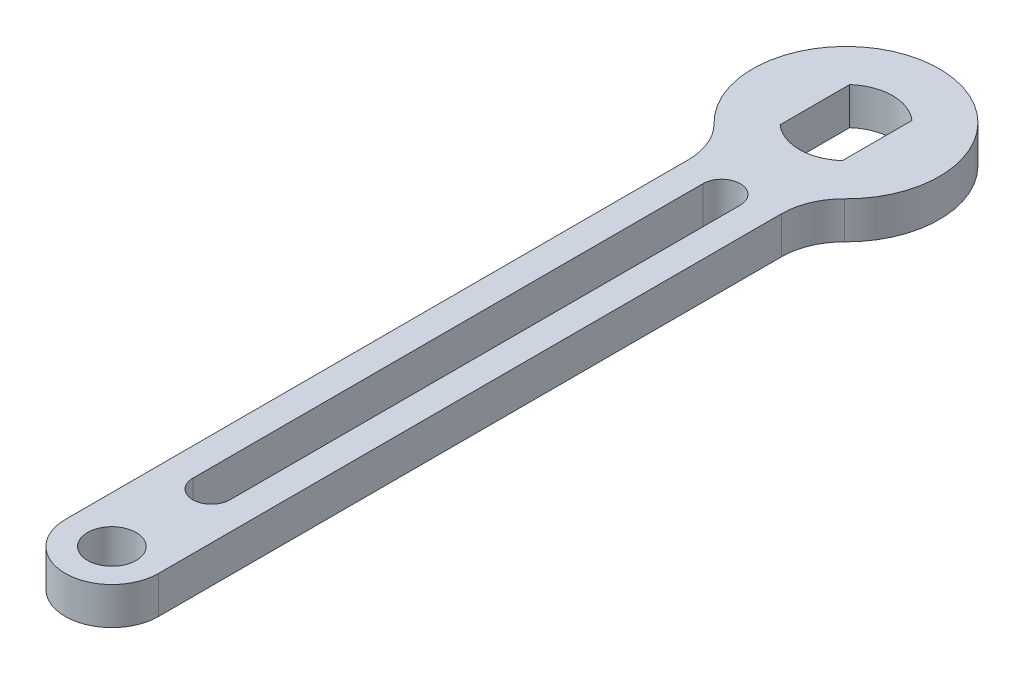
from build123d import *

# Parameters (mm, degrees)
ESQUISSE1_R      = 3.9
EXTRUSION1_DEPTH = 6
CONG_1_R         = 10


with BuildPart() as part:
    # Esquisse1 → Extrusion1 (new body)
    with BuildSketch(Plane(origin=(0, 0, 0), x_dir=(1, 0, 0), z_dir=(0, 1, 0))):
        with BuildLine():
            Line((-7.5, -12.990381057), (-7.5, -118))
            ThreePointArc((-7.5, -118), (0, -125.5), (7.5, -118))
            Line((7.5, -118), (7.5, -12.990381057))
            ThreePointArc((7.5, -12.990381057), (0, 15), (-7.5, -12.990381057))
        make_face()
        with Locations(Location((0, -118, 0), (0, 0, 270))):
            Circle(ESQUISSE1_R, mode=Mode.SUBTRACT)
        with BuildLine():
            Line((-5, -5.590169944), (-5, 5.590169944))
            ThreePointArc((-5, 5.590169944), (0, 7.5), (5, 5.590169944))
            Line((5, 5.590169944), (5, -5.590169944))
            ThreePointArc((5, -5.590169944), (0, -7.5), (-5, -5.590169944))
        make_face(mode=Mode.SUBTRACT)
        with BuildLine():
            Line((3, -20), (3, -102))
            ThreePointArc((3, -102), (0, -105), (-3, -102))
            Line((-3, -102), (-3, -20))
            ThreePointArc((-3, -20), (0, -17), (3, -20))
        make_face(mode=Mode.SUBTRACT)
    extrude(amount=-EXTRUSION1_DEPTH)

    # Cong_1
    cong_1_edges = [part.edges().sort_by_distance(p)[0] for p in [
        (-7.5, -3, 12.990381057),
        (7.5, -3, 12.990381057),
    ]]
    fillet(cong_1_edges, radius=CONG_1_R)


solid = part.part
